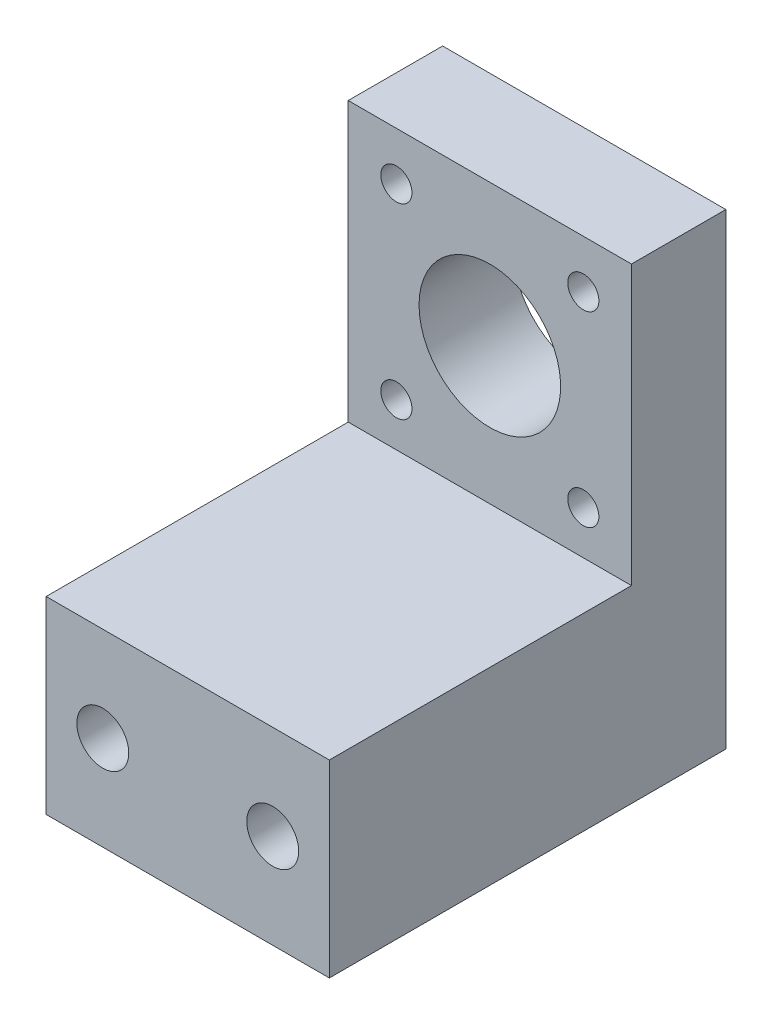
ISO-10303-21;
HEADER;
FILE_DESCRIPTION(('STEP AP214'),'2;1');
FILE_NAME('part.step','',(''),(''),'','','');
FILE_SCHEMA(('AUTOMOTIVE_DESIGN { 1 0 10303 214 1 1 1 1 }'));
ENDSEC;
DATA;
#1=APPLICATION_CONTEXT('core data for automotive mechanical design processes');
#2=APPLICATION_PROTOCOL_DEFINITION('international standard','automotive_design',2000,#1);
#3=PRODUCT_CONTEXT('',#1,'mechanical');
#4=PRODUCT('Part','Part','',(#3));
#5=PRODUCT_RELATED_PRODUCT_CATEGORY('part','',(#4));
#6=PRODUCT_DEFINITION_FORMATION('','',#4);
#7=PRODUCT_DEFINITION_CONTEXT('part definition',#1,'design');
#8=PRODUCT_DEFINITION('design','',#6,#7);
#9=PRODUCT_DEFINITION_SHAPE('','',#8);
#10=(LENGTH_UNIT() NAMED_UNIT(*) SI_UNIT(.MILLI.,.METRE.));
#11=(NAMED_UNIT(*) PLANE_ANGLE_UNIT() SI_UNIT($,.RADIAN.));
#12=(NAMED_UNIT(*) SI_UNIT($,.STERADIAN.) SOLID_ANGLE_UNIT());
#13=UNCERTAINTY_MEASURE_WITH_UNIT(LENGTH_MEASURE(1.E-05),#10,'distance_accuracy_value','');
#14=(GEOMETRIC_REPRESENTATION_CONTEXT(3) GLOBAL_UNCERTAINTY_ASSIGNED_CONTEXT((#13)) GLOBAL_UNIT_ASSIGNED_CONTEXT((#10,
#11,#12)) REPRESENTATION_CONTEXT('',''));
#15=CARTESIAN_POINT('',(0.,0.,0.));
#16=DIRECTION('',(0.,0.,1.));
#17=DIRECTION('',(1.,0.,0.));
#18=AXIS2_PLACEMENT_3D('',#15,#16,#17);
#19=CARTESIAN_POINT('',(6.,10.,42.));
#20=DIRECTION('',(0.,0.,-1.));
#21=DIRECTION('',(-1.,0.,0.));
#22=AXIS2_PLACEMENT_3D('',#19,#20,#21);
#23=CYLINDRICAL_SURFACE('',#22,2.75);
#24=CARTESIAN_POINT('',(6.,10.,42.));
#25=DIRECTION('',(0.,0.,1.));
#26=DIRECTION('',(1.,0.,0.));
#27=AXIS2_PLACEMENT_3D('',#24,#25,#26);
#28=CIRCLE('',#27,2.75);
#29=CARTESIAN_POINT('',(3.25,10.,42.));
#30=VERTEX_POINT('',#29);
#31=EDGE_CURVE('E174',#30,#30,#28,.T.);
#32=CARTESIAN_POINT('',(6.,10.,5.5));
#33=DIRECTION('',(0.,0.,-1.));
#34=DIRECTION('',(-1.,0.,0.));
#35=AXIS2_PLACEMENT_3D('',#32,#33,#34);
#36=CIRCLE('',#35,2.75);
#37=CARTESIAN_POINT('',(3.25,10.,5.50000000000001));
#38=VERTEX_POINT('',#37);
#39=EDGE_CURVE('E37',#38,#38,#36,.T.);
#40=CARTESIAN_POINT('',(3.25,10.,42.));
#41=CARTESIAN_POINT('',(3.25,10.,41.6197916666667));
#42=CARTESIAN_POINT('',(3.25,10.,41.2395833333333));
#43=CARTESIAN_POINT('',(3.25,10.,40.4791666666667));
#44=CARTESIAN_POINT('',(3.25,10.,40.0989583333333));
#45=CARTESIAN_POINT('',(3.25,10.,39.3385416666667));
#46=CARTESIAN_POINT('',(3.25,10.,38.9583333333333));
#47=CARTESIAN_POINT('',(3.25,10.,38.1979166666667));
#48=CARTESIAN_POINT('',(3.25,10.,37.8177083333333));
#49=CARTESIAN_POINT('',(3.25,10.,37.0572916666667));
#50=CARTESIAN_POINT('',(3.25,10.,36.6770833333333));
#51=CARTESIAN_POINT('',(3.25,10.,35.9166666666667));
#52=CARTESIAN_POINT('',(3.25,10.,35.5364583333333));
#53=CARTESIAN_POINT('',(3.25,10.,34.7760416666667));
#54=CARTESIAN_POINT('',(3.25,10.,34.3958333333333));
#55=CARTESIAN_POINT('',(3.25,10.,33.6354166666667));
#56=CARTESIAN_POINT('',(3.25,10.,33.2552083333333));
#57=CARTESIAN_POINT('',(3.25,10.,32.4947916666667));
#58=CARTESIAN_POINT('',(3.25,10.,32.1145833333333));
#59=CARTESIAN_POINT('',(3.25,10.,31.3541666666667));
#60=CARTESIAN_POINT('',(3.25,10.,30.9739583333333));
#61=CARTESIAN_POINT('',(3.25,10.,30.2135416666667));
#62=CARTESIAN_POINT('',(3.25,10.,29.8333333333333));
#63=CARTESIAN_POINT('',(3.25,10.,29.0729166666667));
#64=CARTESIAN_POINT('',(3.25,10.,28.6927083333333));
#65=CARTESIAN_POINT('',(3.25,10.,27.9322916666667));
#66=CARTESIAN_POINT('',(3.25,10.,27.5520833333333));
#67=CARTESIAN_POINT('',(3.25,10.,26.7916666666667));
#68=CARTESIAN_POINT('',(3.25,10.,26.4114583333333));
#69=CARTESIAN_POINT('',(3.25,10.,25.6510416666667));
#70=CARTESIAN_POINT('',(3.25,10.,25.2708333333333));
#71=CARTESIAN_POINT('',(3.25,10.,24.5104166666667));
#72=CARTESIAN_POINT('',(3.25,10.,24.1302083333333));
#73=CARTESIAN_POINT('',(3.25,10.,23.3697916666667));
#74=CARTESIAN_POINT('',(3.25,10.,22.9895833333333));
#75=CARTESIAN_POINT('',(3.25,10.,22.2291666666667));
#76=CARTESIAN_POINT('',(3.25,10.,21.8489583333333));
#77=CARTESIAN_POINT('',(3.25,10.,21.0885416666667));
#78=CARTESIAN_POINT('',(3.25,10.,20.7083333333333));
#79=CARTESIAN_POINT('',(3.25,10.,19.9479166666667));
#80=CARTESIAN_POINT('',(3.25,10.,19.5677083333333));
#81=CARTESIAN_POINT('',(3.25,10.,18.8072916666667));
#82=CARTESIAN_POINT('',(3.25,10.,18.4270833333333));
#83=CARTESIAN_POINT('',(3.25,10.,17.6666666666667));
#84=CARTESIAN_POINT('',(3.25,10.,17.2864583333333));
#85=CARTESIAN_POINT('',(3.25,10.,16.5260416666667));
#86=CARTESIAN_POINT('',(3.25,10.,16.1458333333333));
#87=CARTESIAN_POINT('',(3.25,10.,15.3854166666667));
#88=CARTESIAN_POINT('',(3.25,10.,15.0052083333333));
#89=CARTESIAN_POINT('',(3.25,10.,14.2447916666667));
#90=CARTESIAN_POINT('',(3.25,10.,13.8645833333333));
#91=CARTESIAN_POINT('',(3.25,10.,13.1041666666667));
#92=CARTESIAN_POINT('',(3.25,10.,12.7239583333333));
#93=CARTESIAN_POINT('',(3.25,10.,11.9635416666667));
#94=CARTESIAN_POINT('',(3.25,10.,11.5833333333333));
#95=CARTESIAN_POINT('',(3.25,10.,10.8229166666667));
#96=CARTESIAN_POINT('',(3.25,10.,10.4427083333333));
#97=CARTESIAN_POINT('',(3.25,10.,9.68229166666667));
#98=CARTESIAN_POINT('',(3.25,10.,9.30208333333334));
#99=CARTESIAN_POINT('',(3.25,10.,8.54166666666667));
#100=CARTESIAN_POINT('',(3.25,10.,8.16145833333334));
#101=CARTESIAN_POINT('',(3.25,10.,7.40104166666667));
#102=CARTESIAN_POINT('',(3.25,10.,7.02083333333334));
#103=CARTESIAN_POINT('',(3.25,10.,6.26041666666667));
#104=CARTESIAN_POINT('',(3.25,10.,5.88020833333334));
#105=CARTESIAN_POINT('',(3.25,10.,5.50000000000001));
#106=B_SPLINE_CURVE_WITH_KNOTS('',3,(#40,#41,#42,#43,#44,#45,#46,#47,#48,#49,#50,#51,#52,#53,
#54,#55,#56,#57,#58,#59,#60,#61,#62,#63,#64,#65,#66,#67,#68,#69,#70,#71,#72,#73,#74,#75,#76,#77,
#78,#79,#80,#81,#82,#83,#84,#85,#86,#87,#88,#89,#90,#91,#92,#93,#94,#95,#96,#97,#98,#99,#100,
#101,#102,#103,#104,#105),.UNSPECIFIED.,.F.,.F.,(4,2,2,2,2,2,2,2,2,2,2,2,2,2,2,2,2,2,2,2,2,2,2,
2,2,2,2,2,2,2,2,2,4),(0.,1.140625,2.28125,3.421875,4.5625,5.703125,6.84375,7.98437499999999,
9.12499999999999,10.265625,11.40625,12.546875,13.6875,14.828125,15.96875,17.109375,18.25,
19.390625,20.53125,21.671875,22.8125,23.953125,25.09375,26.234375,27.375,28.515625,29.65625,
30.796875,31.9375,33.078125,34.21875,35.359375,36.5),.UNSPECIFIED.);
#107=EDGE_CURVE('BSEAM33',#30,#38,#106,.T.);
#108=ORIENTED_EDGE('',*,*,#31,.T.);
#109=ORIENTED_EDGE('',*,*,#39,.T.);
#110=ORIENTED_EDGE('',*,*,#107,.T.);
#111=ORIENTED_EDGE('',*,*,#107,.F.);
#112=EDGE_LOOP('',(#108,#110,#109,#111));
#113=FACE_BOUND('',#112,.T.);
#114=ADVANCED_FACE('F33',(#113),#23,.F.);
#115=CARTESIAN_POINT('',(24.,10.,42.));
#116=DIRECTION('',(0.,0.,-1.));
#117=DIRECTION('',(-1.,0.,0.));
#118=AXIS2_PLACEMENT_3D('',#115,#116,#117);
#119=CYLINDRICAL_SURFACE('',#118,2.75);
#120=CARTESIAN_POINT('',(24.,10.,42.));
#121=DIRECTION('',(0.,0.,1.));
#122=DIRECTION('',(1.,0.,0.));
#123=AXIS2_PLACEMENT_3D('',#120,#121,#122);
#124=CIRCLE('',#123,2.75);
#125=CARTESIAN_POINT('',(21.25,10.,42.));
#126=VERTEX_POINT('',#125);
#127=EDGE_CURVE('E107',#126,#126,#124,.T.);
#128=CARTESIAN_POINT('',(24.,10.,5.5));
#129=DIRECTION('',(0.,0.,-1.));
#130=DIRECTION('',(-1.,0.,0.));
#131=AXIS2_PLACEMENT_3D('',#128,#129,#130);
#132=CIRCLE('',#131,2.75);
#133=CARTESIAN_POINT('',(21.25,10.,5.50000000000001));
#134=VERTEX_POINT('',#133);
#135=EDGE_CURVE('E121',#134,#134,#132,.T.);
#136=CARTESIAN_POINT('',(21.25,10.,42.));
#137=CARTESIAN_POINT('',(21.25,10.,41.6197916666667));
#138=CARTESIAN_POINT('',(21.25,10.,41.2395833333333));
#139=CARTESIAN_POINT('',(21.25,10.,40.4791666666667));
#140=CARTESIAN_POINT('',(21.25,10.,40.0989583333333));
#141=CARTESIAN_POINT('',(21.25,10.,39.3385416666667));
#142=CARTESIAN_POINT('',(21.25,10.,38.9583333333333));
#143=CARTESIAN_POINT('',(21.25,10.,38.1979166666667));
#144=CARTESIAN_POINT('',(21.25,10.,37.8177083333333));
#145=CARTESIAN_POINT('',(21.25,10.,37.0572916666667));
#146=CARTESIAN_POINT('',(21.25,10.,36.6770833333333));
#147=CARTESIAN_POINT('',(21.25,10.,35.9166666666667));
#148=CARTESIAN_POINT('',(21.25,10.,35.5364583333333));
#149=CARTESIAN_POINT('',(21.25,10.,34.7760416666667));
#150=CARTESIAN_POINT('',(21.25,10.,34.3958333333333));
#151=CARTESIAN_POINT('',(21.25,10.,33.6354166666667));
#152=CARTESIAN_POINT('',(21.25,10.,33.2552083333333));
#153=CARTESIAN_POINT('',(21.25,10.,32.4947916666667));
#154=CARTESIAN_POINT('',(21.25,10.,32.1145833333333));
#155=CARTESIAN_POINT('',(21.25,10.,31.3541666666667));
#156=CARTESIAN_POINT('',(21.25,10.,30.9739583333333));
#157=CARTESIAN_POINT('',(21.25,10.,30.2135416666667));
#158=CARTESIAN_POINT('',(21.25,10.,29.8333333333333));
#159=CARTESIAN_POINT('',(21.25,10.,29.0729166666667));
#160=CARTESIAN_POINT('',(21.25,10.,28.6927083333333));
#161=CARTESIAN_POINT('',(21.25,10.,27.9322916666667));
#162=CARTESIAN_POINT('',(21.25,10.,27.5520833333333));
#163=CARTESIAN_POINT('',(21.25,10.,26.7916666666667));
#164=CARTESIAN_POINT('',(21.25,10.,26.4114583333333));
#165=CARTESIAN_POINT('',(21.25,10.,25.6510416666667));
#166=CARTESIAN_POINT('',(21.25,10.,25.2708333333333));
#167=CARTESIAN_POINT('',(21.25,10.,24.5104166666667));
#168=CARTESIAN_POINT('',(21.25,10.,24.1302083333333));
#169=CARTESIAN_POINT('',(21.25,10.,23.3697916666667));
#170=CARTESIAN_POINT('',(21.25,10.,22.9895833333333));
#171=CARTESIAN_POINT('',(21.25,10.,22.2291666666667));
#172=CARTESIAN_POINT('',(21.25,10.,21.8489583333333));
#173=CARTESIAN_POINT('',(21.25,10.,21.0885416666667));
#174=CARTESIAN_POINT('',(21.25,10.,20.7083333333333));
#175=CARTESIAN_POINT('',(21.25,10.,19.9479166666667));
#176=CARTESIAN_POINT('',(21.25,10.,19.5677083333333));
#177=CARTESIAN_POINT('',(21.25,10.,18.8072916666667));
#178=CARTESIAN_POINT('',(21.25,10.,18.4270833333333));
#179=CARTESIAN_POINT('',(21.25,10.,17.6666666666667));
#180=CARTESIAN_POINT('',(21.25,10.,17.2864583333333));
#181=CARTESIAN_POINT('',(21.25,10.,16.5260416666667));
#182=CARTESIAN_POINT('',(21.25,10.,16.1458333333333));
#183=CARTESIAN_POINT('',(21.25,10.,15.3854166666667));
#184=CARTESIAN_POINT('',(21.25,10.,15.0052083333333));
#185=CARTESIAN_POINT('',(21.25,10.,14.2447916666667));
#186=CARTESIAN_POINT('',(21.25,10.,13.8645833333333));
#187=CARTESIAN_POINT('',(21.25,10.,13.1041666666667));
#188=CARTESIAN_POINT('',(21.25,10.,12.7239583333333));
#189=CARTESIAN_POINT('',(21.25,10.,11.9635416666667));
#190=CARTESIAN_POINT('',(21.25,10.,11.5833333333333));
#191=CARTESIAN_POINT('',(21.25,10.,10.8229166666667));
#192=CARTESIAN_POINT('',(21.25,10.,10.4427083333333));
#193=CARTESIAN_POINT('',(21.25,10.,9.68229166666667));
#194=CARTESIAN_POINT('',(21.25,10.,9.30208333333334));
#195=CARTESIAN_POINT('',(21.25,10.,8.54166666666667));
#196=CARTESIAN_POINT('',(21.25,10.,8.16145833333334));
#197=CARTESIAN_POINT('',(21.25,10.,7.40104166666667));
#198=CARTESIAN_POINT('',(21.25,10.,7.02083333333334));
#199=CARTESIAN_POINT('',(21.25,10.,6.26041666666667));
#200=CARTESIAN_POINT('',(21.25,10.,5.88020833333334));
#201=CARTESIAN_POINT('',(21.25,10.,5.50000000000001));
#202=B_SPLINE_CURVE_WITH_KNOTS('',3,(#136,#137,#138,#139,#140,#141,#142,#143,#144,#145,#146,
#147,#148,#149,#150,#151,#152,#153,#154,#155,#156,#157,#158,#159,#160,#161,#162,#163,#164,#165,
#166,#167,#168,#169,#170,#171,#172,#173,#174,#175,#176,#177,#178,#179,#180,#181,#182,#183,#184,
#185,#186,#187,#188,#189,#190,#191,#192,#193,#194,#195,#196,#197,#198,#199,#200,#201),
.UNSPECIFIED.,.F.,.F.,(4,2,2,2,2,2,2,2,2,2,2,2,2,2,2,2,2,2,2,2,2,2,2,2,2,2,2,2,2,2,2,2,4),(0.,
1.140625,2.28125,3.421875,4.5625,5.703125,6.84375,7.98437499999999,9.12499999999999,10.265625,
11.40625,12.546875,13.6875,14.828125,15.96875,17.109375,18.25,19.390625,20.53125,21.671875,
22.8125,23.953125,25.09375,26.234375,27.375,28.515625,29.65625,30.796875,31.9375,33.078125,
34.21875,35.359375,36.5),.UNSPECIFIED.);
#203=EDGE_CURVE('BSEAM209',#126,#134,#202,.T.);
#204=ORIENTED_EDGE('',*,*,#127,.T.);
#205=ORIENTED_EDGE('',*,*,#135,.T.);
#206=ORIENTED_EDGE('',*,*,#203,.T.);
#207=ORIENTED_EDGE('',*,*,#203,.F.);
#208=EDGE_LOOP('',(#204,#206,#205,#207));
#209=FACE_BOUND('',#208,.T.);
#210=ADVANCED_FACE('F209',(#209),#119,.F.);
#211=CARTESIAN_POINT('',(30.,-1.13686837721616E-13,42.));
#212=DIRECTION('',(0.,0.,1.));
#213=DIRECTION('',(1.,0.,0.));
#214=AXIS2_PLACEMENT_3D('',#211,#212,#213);
#215=PLANE('',#214);
#216=ORIENTED_EDGE('',*,*,#31,.F.);
#217=EDGE_LOOP('',(#216));
#218=FACE_BOUND('',#217,.T.);
#219=ORIENTED_EDGE('',*,*,#127,.F.);
#220=EDGE_LOOP('',(#219));
#221=FACE_BOUND('',#220,.T.);
#222=DIRECTION('',(0.,1.,0.));
#223=VECTOR('',#222,1.);
#224=CARTESIAN_POINT('',(30.,-1.13686837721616E-13,42.));
#225=LINE('',#224,#223);
#226=CARTESIAN_POINT('',(30.,-1.13686837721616E-13,42.));
#227=VERTEX_POINT('',#226);
#228=CARTESIAN_POINT('',(30.,20.,42.));
#229=VERTEX_POINT('',#228);
#230=EDGE_CURVE('E179',#227,#229,#225,.T.);
#231=ORIENTED_EDGE('',*,*,#230,.T.);
#232=DIRECTION('',(1.,0.,0.));
#233=VECTOR('',#232,1.);
#234=CARTESIAN_POINT('',(-12.,20.,42.));
#235=LINE('',#234,#233);
#236=CARTESIAN_POINT('',(0.,20.,42.));
#237=VERTEX_POINT('',#236);
#238=EDGE_CURVE('E120',#237,#229,#235,.T.);
#239=ORIENTED_EDGE('',*,*,#238,.F.);
#240=DIRECTION('',(0.,-1.,0.));
#241=VECTOR('',#240,1.);
#242=CARTESIAN_POINT('',(0.,-1.13686837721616E-13,42.));
#243=LINE('',#242,#241);
#244=CARTESIAN_POINT('',(0.,-1.13686837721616E-13,42.));
#245=VERTEX_POINT('',#244);
#246=EDGE_CURVE('E59',#237,#245,#243,.T.);
#247=ORIENTED_EDGE('',*,*,#246,.T.);
#248=DIRECTION('',(1.,0.,0.));
#249=VECTOR('',#248,1.);
#250=CARTESIAN_POINT('',(0.,-1.13686837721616E-13,42.));
#251=LINE('',#250,#249);
#252=EDGE_CURVE('E90',#245,#227,#251,.T.);
#253=ORIENTED_EDGE('',*,*,#252,.T.);
#254=EDGE_LOOP('',(#231,#239,#247,#253));
#255=FACE_BOUND('',#254,.T.);
#256=ADVANCED_FACE('F182',(#218,#221,#255),#215,.T.);
#257=CARTESIAN_POINT('',(30.,-1.13686837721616E-13,42.));
#258=DIRECTION('',(-1.,0.,0.));
#259=DIRECTION('',(0.,0.,1.));
#260=AXIS2_PLACEMENT_3D('',#257,#258,#259);
#261=PLANE('',#260);
#262=DIRECTION('',(0.,0.,1.));
#263=VECTOR('',#262,1.);
#264=CARTESIAN_POINT('',(30.,20.,42.));
#265=LINE('',#264,#263);
#266=CARTESIAN_POINT('',(30.,20.,10.));
#267=VERTEX_POINT('',#266);
#268=EDGE_CURVE('E164',#267,#229,#265,.T.);
#269=ORIENTED_EDGE('',*,*,#268,.T.);
#270=ORIENTED_EDGE('',*,*,#230,.F.);
#271=DIRECTION('',(0.,0.,-1.));
#272=VECTOR('',#271,1.);
#273=CARTESIAN_POINT('',(30.,-1.13686837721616E-13,42.));
#274=LINE('',#273,#272);
#275=CARTESIAN_POINT('',(30.,-1.13686837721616E-13,0.));
#276=VERTEX_POINT('',#275);
#277=EDGE_CURVE('E42',#227,#276,#274,.T.);
#278=ORIENTED_EDGE('',*,*,#277,.T.);
#279=DIRECTION('',(0.,1.,0.));
#280=VECTOR('',#279,1.);
#281=CARTESIAN_POINT('',(30.,-1.13686837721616E-13,0.));
#282=LINE('',#281,#280);
#283=CARTESIAN_POINT('',(30.,49.5,0.));
#284=VERTEX_POINT('',#283);
#285=EDGE_CURVE('E101',#276,#284,#282,.T.);
#286=ORIENTED_EDGE('',*,*,#285,.T.);
#287=DIRECTION('',(0.,0.,-1.));
#288=VECTOR('',#287,1.);
#289=CARTESIAN_POINT('',(30.,49.5,42.));
#290=LINE('',#289,#288);
#291=CARTESIAN_POINT('',(30.,49.5,10.));
#292=VERTEX_POINT('',#291);
#293=EDGE_CURVE('E114',#292,#284,#290,.T.);
#294=ORIENTED_EDGE('',*,*,#293,.F.);
#295=DIRECTION('',(0.,-1.,0.));
#296=VECTOR('',#295,1.);
#297=CARTESIAN_POINT('',(30.,20.,10.));
#298=LINE('',#297,#296);
#299=EDGE_CURVE('E161',#292,#267,#298,.T.);
#300=ORIENTED_EDGE('',*,*,#299,.T.);
#301=EDGE_LOOP('',(#269,#270,#278,#286,#294,#300));
#302=FACE_BOUND('',#301,.T.);
#303=ADVANCED_FACE('F187',(#302),#261,.F.);
#304=CARTESIAN_POINT('',(0.,49.5,42.));
#305=DIRECTION('',(0.,-1.,0.));
#306=DIRECTION('',(0.,0.,-1.));
#307=AXIS2_PLACEMENT_3D('',#304,#305,#306);
#308=PLANE('',#307);
#309=DIRECTION('',(1.,0.,0.));
#310=VECTOR('',#309,1.);
#311=CARTESIAN_POINT('',(-12.,49.5,10.));
#312=LINE('',#311,#310);
#313=CARTESIAN_POINT('',(0.,49.5,10.));
#314=VERTEX_POINT('',#313);
#315=EDGE_CURVE('E50',#314,#292,#312,.T.);
#316=ORIENTED_EDGE('',*,*,#315,.T.);
#317=ORIENTED_EDGE('',*,*,#293,.T.);
#318=DIRECTION('',(-1.,0.,0.));
#319=VECTOR('',#318,1.);
#320=CARTESIAN_POINT('',(0.,49.5,0.));
#321=LINE('',#320,#319);
#322=CARTESIAN_POINT('',(0.,49.5,0.));
#323=VERTEX_POINT('',#322);
#324=EDGE_CURVE('E91',#284,#323,#321,.T.);
#325=ORIENTED_EDGE('',*,*,#324,.T.);
#326=DIRECTION('',(0.,0.,-1.));
#327=VECTOR('',#326,1.);
#328=CARTESIAN_POINT('',(0.,49.5,42.));
#329=LINE('',#328,#327);
#330=EDGE_CURVE('E85',#314,#323,#329,.T.);
#331=ORIENTED_EDGE('',*,*,#330,.F.);
#332=EDGE_LOOP('',(#316,#317,#325,#331));
#333=FACE_BOUND('',#332,.T.);
#334=ADVANCED_FACE('F199',(#333),#308,.F.);
#335=CARTESIAN_POINT('',(0.,-1.13686837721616E-13,42.));
#336=DIRECTION('',(1.,0.,0.));
#337=DIRECTION('',(0.,0.,-1.));
#338=AXIS2_PLACEMENT_3D('',#335,#336,#337);
#339=PLANE('',#338);
#340=DIRECTION('',(0.,0.,1.));
#341=VECTOR('',#340,1.);
#342=CARTESIAN_POINT('',(0.,20.,42.));
#343=LINE('',#342,#341);
#344=CARTESIAN_POINT('',(0.,20.,10.));
#345=VERTEX_POINT('',#344);
#346=EDGE_CURVE('E12',#345,#237,#343,.T.);
#347=ORIENTED_EDGE('',*,*,#346,.F.);
#348=DIRECTION('',(0.,-1.,0.));
#349=VECTOR('',#348,1.);
#350=CARTESIAN_POINT('',(0.,-1.13686837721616E-13,10.));
#351=LINE('',#350,#349);
#352=EDGE_CURVE('E119',#314,#345,#351,.T.);
#353=ORIENTED_EDGE('',*,*,#352,.F.);
#354=ORIENTED_EDGE('',*,*,#330,.T.);
#355=DIRECTION('',(0.,-1.,0.));
#356=VECTOR('',#355,1.);
#357=CARTESIAN_POINT('',(0.,-1.13686837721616E-13,0.));
#358=LINE('',#357,#356);
#359=CARTESIAN_POINT('',(0.,-1.13686837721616E-13,0.));
#360=VERTEX_POINT('',#359);
#361=EDGE_CURVE('E78',#323,#360,#358,.T.);
#362=ORIENTED_EDGE('',*,*,#361,.T.);
#363=DIRECTION('',(0.,0.,-1.));
#364=VECTOR('',#363,1.);
#365=CARTESIAN_POINT('',(0.,-1.13686837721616E-13,42.));
#366=LINE('',#365,#364);
#367=EDGE_CURVE('E82',#245,#360,#366,.T.);
#368=ORIENTED_EDGE('',*,*,#367,.F.);
#369=ORIENTED_EDGE('',*,*,#246,.F.);
#370=EDGE_LOOP('',(#347,#353,#354,#362,#368,#369));
#371=FACE_BOUND('',#370,.T.);
#372=ADVANCED_FACE('F81',(#371),#339,.F.);
#373=CARTESIAN_POINT('',(15.,34.5,42.));
#374=DIRECTION('',(0.,0.,-1.));
#375=DIRECTION('',(-1.,0.,0.));
#376=AXIS2_PLACEMENT_3D('',#373,#374,#375);
#377=CYLINDRICAL_SURFACE('',#376,7.5);
#378=CARTESIAN_POINT('',(15.,34.5,0.));
#379=DIRECTION('',(0.,0.,1.));
#380=DIRECTION('',(1.,0.,0.));
#381=AXIS2_PLACEMENT_3D('',#378,#379,#380);
#382=CIRCLE('',#381,7.5);
#383=CARTESIAN_POINT('',(7.5,34.5,0.));
#384=VERTEX_POINT('',#383);
#385=EDGE_CURVE('E103',#384,#384,#382,.T.);
#386=CARTESIAN_POINT('',(15.,34.5,10.));
#387=DIRECTION('',(0.,0.,1.));
#388=DIRECTION('',(1.,0.,0.));
#389=AXIS2_PLACEMENT_3D('',#386,#387,#388);
#390=CIRCLE('',#389,7.5);
#391=CARTESIAN_POINT('',(7.5,34.5,9.99999999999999));
#392=VERTEX_POINT('',#391);
#393=EDGE_CURVE('E117',#392,#392,#390,.T.);
#394=CARTESIAN_POINT('',(7.5,34.5,0.));
#395=CARTESIAN_POINT('',(7.5,34.5,0.104166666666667));
#396=CARTESIAN_POINT('',(7.5,34.5,0.208333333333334));
#397=CARTESIAN_POINT('',(7.5,34.5,0.416666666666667));
#398=CARTESIAN_POINT('',(7.5,34.5,0.520833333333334));
#399=CARTESIAN_POINT('',(7.5,34.5,0.729166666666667));
#400=CARTESIAN_POINT('',(7.5,34.5,0.833333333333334));
#401=CARTESIAN_POINT('',(7.5,34.5,1.04166666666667));
#402=CARTESIAN_POINT('',(7.5,34.5,1.14583333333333));
#403=CARTESIAN_POINT('',(7.5,34.5,1.35416666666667));
#404=CARTESIAN_POINT('',(7.5,34.5,1.45833333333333));
#405=CARTESIAN_POINT('',(7.5,34.5,1.66666666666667));
#406=CARTESIAN_POINT('',(7.5,34.5,1.77083333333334));
#407=CARTESIAN_POINT('',(7.5,34.5,1.97916666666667));
#408=CARTESIAN_POINT('',(7.5,34.5,2.08333333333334));
#409=CARTESIAN_POINT('',(7.5,34.5,2.29166666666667));
#410=CARTESIAN_POINT('',(7.5,34.5,2.39583333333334));
#411=CARTESIAN_POINT('',(7.5,34.5,2.60416666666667));
#412=CARTESIAN_POINT('',(7.5,34.5,2.70833333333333));
#413=CARTESIAN_POINT('',(7.5,34.5,2.91666666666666));
#414=CARTESIAN_POINT('',(7.5,34.5,3.02083333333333));
#415=CARTESIAN_POINT('',(7.5,34.5,3.22916666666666));
#416=CARTESIAN_POINT('',(7.5,34.5,3.33333333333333));
#417=CARTESIAN_POINT('',(7.5,34.5,3.54166666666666));
#418=CARTESIAN_POINT('',(7.5,34.5,3.64583333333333));
#419=CARTESIAN_POINT('',(7.5,34.5,3.85416666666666));
#420=CARTESIAN_POINT('',(7.5,34.5,3.95833333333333));
#421=CARTESIAN_POINT('',(7.5,34.5,4.16666666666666));
#422=CARTESIAN_POINT('',(7.5,34.5,4.27083333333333));
#423=CARTESIAN_POINT('',(7.5,34.5,4.47916666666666));
#424=CARTESIAN_POINT('',(7.5,34.5,4.58333333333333));
#425=CARTESIAN_POINT('',(7.5,34.5,4.79166666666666));
#426=CARTESIAN_POINT('',(7.5,34.5,4.89583333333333));
#427=CARTESIAN_POINT('',(7.5,34.5,5.10416666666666));
#428=CARTESIAN_POINT('',(7.5,34.5,5.20833333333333));
#429=CARTESIAN_POINT('',(7.5,34.5,5.41666666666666));
#430=CARTESIAN_POINT('',(7.5,34.5,5.52083333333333));
#431=CARTESIAN_POINT('',(7.5,34.5,5.72916666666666));
#432=CARTESIAN_POINT('',(7.5,34.5,5.83333333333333));
#433=CARTESIAN_POINT('',(7.5,34.5,6.04166666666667));
#434=CARTESIAN_POINT('',(7.5,34.5,6.14583333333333));
#435=CARTESIAN_POINT('',(7.5,34.5,6.35416666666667));
#436=CARTESIAN_POINT('',(7.5,34.5,6.45833333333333));
#437=CARTESIAN_POINT('',(7.5,34.5,6.66666666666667));
#438=CARTESIAN_POINT('',(7.5,34.5,6.77083333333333));
#439=CARTESIAN_POINT('',(7.5,34.5,6.97916666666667));
#440=CARTESIAN_POINT('',(7.5,34.5,7.08333333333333));
#441=CARTESIAN_POINT('',(7.5,34.5,7.29166666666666));
#442=CARTESIAN_POINT('',(7.5,34.5,7.39583333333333));
#443=CARTESIAN_POINT('',(7.5,34.5,7.60416666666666));
#444=CARTESIAN_POINT('',(7.5,34.5,7.70833333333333));
#445=CARTESIAN_POINT('',(7.5,34.5,7.91666666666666));
#446=CARTESIAN_POINT('',(7.5,34.5,8.02083333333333));
#447=CARTESIAN_POINT('',(7.5,34.5,8.22916666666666));
#448=CARTESIAN_POINT('',(7.5,34.5,8.33333333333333));
#449=CARTESIAN_POINT('',(7.5,34.5,8.54166666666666));
#450=CARTESIAN_POINT('',(7.5,34.5,8.64583333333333));
#451=CARTESIAN_POINT('',(7.5,34.5,8.85416666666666));
#452=CARTESIAN_POINT('',(7.5,34.5,8.95833333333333));
#453=CARTESIAN_POINT('',(7.5,34.5,9.16666666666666));
#454=CARTESIAN_POINT('',(7.5,34.5,9.27083333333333));
#455=CARTESIAN_POINT('',(7.5,34.5,9.47916666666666));
#456=CARTESIAN_POINT('',(7.5,34.5,9.58333333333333));
#457=CARTESIAN_POINT('',(7.5,34.5,9.79166666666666));
#458=CARTESIAN_POINT('',(7.5,34.5,9.89583333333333));
#459=CARTESIAN_POINT('',(7.5,34.5,9.99999999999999));
#460=B_SPLINE_CURVE_WITH_KNOTS('',3,(#394,#395,#396,#397,#398,#399,#400,#401,#402,#403,#404,
#405,#406,#407,#408,#409,#410,#411,#412,#413,#414,#415,#416,#417,#418,#419,#420,#421,#422,#423,
#424,#425,#426,#427,#428,#429,#430,#431,#432,#433,#434,#435,#436,#437,#438,#439,#440,#441,#442,
#443,#444,#445,#446,#447,#448,#449,#450,#451,#452,#453,#454,#455,#456,#457,#458,#459),
.UNSPECIFIED.,.F.,.F.,(4,2,2,2,2,2,2,2,2,2,2,2,2,2,2,2,2,2,2,2,2,2,2,2,2,2,2,2,2,2,2,2,4),(0.,
0.3125,0.625000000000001,0.937500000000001,1.25,1.5625,1.875,2.1875,2.5,2.8125,3.125,3.4375,
3.75,4.0625,4.375,4.6875,5.,5.3125,5.625,5.9375,6.25,6.5625,6.875,7.1875,7.49999999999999,
7.8125,8.12499999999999,8.43749999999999,8.74999999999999,9.06249999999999,9.37499999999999,
9.68749999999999,9.99999999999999),.UNSPECIFIED.);
#461=EDGE_CURVE('BSEAM206',#384,#392,#460,.T.);
#462=ORIENTED_EDGE('',*,*,#385,.F.);
#463=ORIENTED_EDGE('',*,*,#393,.T.);
#464=ORIENTED_EDGE('',*,*,#461,.T.);
#465=ORIENTED_EDGE('',*,*,#461,.F.);
#466=EDGE_LOOP('',(#462,#464,#463,#465));
#467=FACE_BOUND('',#466,.T.);
#468=ADVANCED_FACE('F206',(#467),#377,.F.);
#469=CARTESIAN_POINT('',(30.,-1.13686837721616E-13,0.));
#470=DIRECTION('',(0.,0.,1.));
#471=DIRECTION('',(1.,0.,0.));
#472=AXIS2_PLACEMENT_3D('',#469,#470,#471);
#473=PLANE('',#472);
#474=CARTESIAN_POINT('',(6.,10.,0.));
#475=DIRECTION('',(0.,0.,-1.));
#476=DIRECTION('',(-1.,0.,0.));
#477=AXIS2_PLACEMENT_3D('',#474,#475,#476);
#478=CIRCLE('',#477,4.75);
#479=CARTESIAN_POINT('',(1.25,10.,0.));
#480=VERTEX_POINT('',#479);
#481=EDGE_CURVE('E138',#480,#480,#478,.T.);
#482=ORIENTED_EDGE('',*,*,#481,.F.);
#483=EDGE_LOOP('',(#482));
#484=FACE_BOUND('',#483,.T.);
#485=CARTESIAN_POINT('',(24.,10.,0.));
#486=DIRECTION('',(0.,0.,-1.));
#487=DIRECTION('',(-1.,0.,0.));
#488=AXIS2_PLACEMENT_3D('',#485,#486,#487);
#489=CIRCLE('',#488,4.75);
#490=CARTESIAN_POINT('',(19.25,10.,0.));
#491=VERTEX_POINT('',#490);
#492=EDGE_CURVE('E131',#491,#491,#489,.T.);
#493=ORIENTED_EDGE('',*,*,#492,.F.);
#494=EDGE_LOOP('',(#493));
#495=FACE_BOUND('',#494,.T.);
#496=CARTESIAN_POINT('',(5.09999999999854,44.4000000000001,0.));
#497=DIRECTION('',(0.,0.,1.));
#498=DIRECTION('',(1.,0.,0.));
#499=AXIS2_PLACEMENT_3D('',#496,#497,#498);
#500=CIRCLE('',#499,1.65);
#501=CARTESIAN_POINT('',(6.74999999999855,44.4000000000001,0.));
#502=VERTEX_POINT('',#501);
#503=EDGE_CURVE('E128',#502,#502,#500,.T.);
#504=ORIENTED_EDGE('',*,*,#503,.T.);
#505=EDGE_LOOP('',(#504));
#506=FACE_BOUND('',#505,.T.);
#507=CARTESIAN_POINT('',(24.8999999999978,24.5999999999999,0.));
#508=DIRECTION('',(0.,0.,1.));
#509=DIRECTION('',(1.,0.,0.));
#510=AXIS2_PLACEMENT_3D('',#507,#508,#509);
#511=CIRCLE('',#510,1.65);
#512=CARTESIAN_POINT('',(26.5499999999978,24.5999999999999,0.));
#513=VERTEX_POINT('',#512);
#514=EDGE_CURVE('E146',#513,#513,#511,.T.);
#515=ORIENTED_EDGE('',*,*,#514,.T.);
#516=EDGE_LOOP('',(#515));
#517=FACE_BOUND('',#516,.T.);
#518=CARTESIAN_POINT('',(24.8999999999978,44.4000000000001,0.));
#519=DIRECTION('',(0.,0.,1.));
#520=DIRECTION('',(1.,0.,0.));
#521=AXIS2_PLACEMENT_3D('',#518,#519,#520);
#522=CIRCLE('',#521,1.65);
#523=CARTESIAN_POINT('',(26.5499999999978,44.4000000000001,0.));
#524=VERTEX_POINT('',#523);
#525=EDGE_CURVE('E152',#524,#524,#522,.T.);
#526=ORIENTED_EDGE('',*,*,#525,.T.);
#527=EDGE_LOOP('',(#526));
#528=FACE_BOUND('',#527,.T.);
#529=CARTESIAN_POINT('',(5.09999999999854,24.5999999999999,0.));
#530=DIRECTION('',(0.,0.,1.));
#531=DIRECTION('',(1.,0.,0.));
#532=AXIS2_PLACEMENT_3D('',#529,#530,#531);
#533=CIRCLE('',#532,1.65);
#534=CARTESIAN_POINT('',(6.74999999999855,24.5999999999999,0.));
#535=VERTEX_POINT('',#534);
#536=EDGE_CURVE('E158',#535,#535,#533,.T.);
#537=ORIENTED_EDGE('',*,*,#536,.T.);
#538=EDGE_LOOP('',(#537));
#539=FACE_BOUND('',#538,.T.);
#540=DIRECTION('',(1.,0.,0.));
#541=VECTOR('',#540,1.);
#542=CARTESIAN_POINT('',(0.,-1.13686837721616E-13,0.));
#543=LINE('',#542,#541);
#544=EDGE_CURVE('E96',#360,#276,#543,.T.);
#545=ORIENTED_EDGE('',*,*,#544,.F.);
#546=ORIENTED_EDGE('',*,*,#361,.F.);
#547=ORIENTED_EDGE('',*,*,#324,.F.);
#548=ORIENTED_EDGE('',*,*,#285,.F.);
#549=EDGE_LOOP('',(#545,#546,#547,#548));
#550=FACE_BOUND('',#549,.T.);
#551=ORIENTED_EDGE('',*,*,#385,.T.);
#552=EDGE_LOOP('',(#551));
#553=FACE_BOUND('',#552,.T.);
#554=ADVANCED_FACE('F98',(#484,#495,#506,#517,#528,#539,#550,#553),#473,.F.);
#555=CARTESIAN_POINT('',(0.,-1.13686837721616E-13,42.));
#556=DIRECTION('',(0.,1.,0.));
#557=DIRECTION('',(0.,0.,1.));
#558=AXIS2_PLACEMENT_3D('',#555,#556,#557);
#559=PLANE('',#558);
#560=ORIENTED_EDGE('',*,*,#544,.T.);
#561=ORIENTED_EDGE('',*,*,#277,.F.);
#562=ORIENTED_EDGE('',*,*,#252,.F.);
#563=ORIENTED_EDGE('',*,*,#367,.T.);
#564=EDGE_LOOP('',(#560,#561,#562,#563));
#565=FACE_BOUND('',#564,.T.);
#566=ADVANCED_FACE('F35',(#565),#559,.F.);
#567=CARTESIAN_POINT('',(-12.,20.,42.));
#568=DIRECTION('',(0.,1.,0.));
#569=DIRECTION('',(0.,0.,1.));
#570=AXIS2_PLACEMENT_3D('',#567,#568,#569);
#571=PLANE('',#570);
#572=ORIENTED_EDGE('',*,*,#346,.T.);
#573=ORIENTED_EDGE('',*,*,#238,.T.);
#574=ORIENTED_EDGE('',*,*,#268,.F.);
#575=DIRECTION('',(1.,0.,0.));
#576=VECTOR('',#575,1.);
#577=CARTESIAN_POINT('',(-12.,20.,10.));
#578=LINE('',#577,#576);
#579=EDGE_CURVE('E169',#345,#267,#578,.T.);
#580=ORIENTED_EDGE('',*,*,#579,.F.);
#581=EDGE_LOOP('',(#572,#573,#574,#580));
#582=FACE_BOUND('',#581,.T.);
#583=ADVANCED_FACE('F192',(#582),#571,.T.);
#584=CARTESIAN_POINT('',(-12.,20.,10.));
#585=DIRECTION('',(0.,0.,1.));
#586=DIRECTION('',(1.,0.,0.));
#587=AXIS2_PLACEMENT_3D('',#584,#585,#586);
#588=PLANE('',#587);
#589=CARTESIAN_POINT('',(5.09999999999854,44.4000000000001,10.));
#590=DIRECTION('',(0.,0.,1.));
#591=DIRECTION('',(1.,0.,0.));
#592=AXIS2_PLACEMENT_3D('',#589,#590,#591);
#593=CIRCLE('',#592,1.65);
#594=CARTESIAN_POINT('',(6.74999999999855,44.4000000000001,10.));
#595=VERTEX_POINT('',#594);
#596=EDGE_CURVE('E123',#595,#595,#593,.T.);
#597=ORIENTED_EDGE('',*,*,#596,.F.);
#598=EDGE_LOOP('',(#597));
#599=FACE_BOUND('',#598,.T.);
#600=CARTESIAN_POINT('',(24.8999999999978,24.5999999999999,10.));
#601=DIRECTION('',(0.,0.,1.));
#602=DIRECTION('',(1.,0.,0.));
#603=AXIS2_PLACEMENT_3D('',#600,#601,#602);
#604=CIRCLE('',#603,1.65);
#605=CARTESIAN_POINT('',(26.5499999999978,24.5999999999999,10.));
#606=VERTEX_POINT('',#605);
#607=EDGE_CURVE('E143',#606,#606,#604,.T.);
#608=ORIENTED_EDGE('',*,*,#607,.F.);
#609=EDGE_LOOP('',(#608));
#610=FACE_BOUND('',#609,.T.);
#611=CARTESIAN_POINT('',(24.8999999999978,44.4000000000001,10.));
#612=DIRECTION('',(0.,0.,1.));
#613=DIRECTION('',(1.,0.,0.));
#614=AXIS2_PLACEMENT_3D('',#611,#612,#613);
#615=CIRCLE('',#614,1.65);
#616=CARTESIAN_POINT('',(26.5499999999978,44.4000000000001,10.));
#617=VERTEX_POINT('',#616);
#618=EDGE_CURVE('E149',#617,#617,#615,.T.);
#619=ORIENTED_EDGE('',*,*,#618,.F.);
#620=EDGE_LOOP('',(#619));
#621=FACE_BOUND('',#620,.T.);
#622=CARTESIAN_POINT('',(5.09999999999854,24.5999999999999,10.));
#623=DIRECTION('',(0.,0.,1.));
#624=DIRECTION('',(1.,0.,0.));
#625=AXIS2_PLACEMENT_3D('',#622,#623,#624);
#626=CIRCLE('',#625,1.65);
#627=CARTESIAN_POINT('',(6.74999999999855,24.5999999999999,10.));
#628=VERTEX_POINT('',#627);
#629=EDGE_CURVE('E155',#628,#628,#626,.T.);
#630=ORIENTED_EDGE('',*,*,#629,.F.);
#631=EDGE_LOOP('',(#630));
#632=FACE_BOUND('',#631,.T.);
#633=ORIENTED_EDGE('',*,*,#393,.F.);
#634=EDGE_LOOP('',(#633));
#635=FACE_BOUND('',#634,.T.);
#636=ORIENTED_EDGE('',*,*,#352,.T.);
#637=ORIENTED_EDGE('',*,*,#579,.T.);
#638=ORIENTED_EDGE('',*,*,#299,.F.);
#639=ORIENTED_EDGE('',*,*,#315,.F.);
#640=EDGE_LOOP('',(#636,#637,#638,#639));
#641=FACE_BOUND('',#640,.T.);
#642=ADVANCED_FACE('F197',(#599,#610,#621,#632,#635,#641),#588,.T.);
#643=CARTESIAN_POINT('',(5.09999999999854,24.5999999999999,-32.));
#644=DIRECTION('',(0.,0.,1.));
#645=DIRECTION('',(1.,0.,0.));
#646=AXIS2_PLACEMENT_3D('',#643,#644,#645);
#647=CYLINDRICAL_SURFACE('',#646,1.65);
#648=CARTESIAN_POINT('',(6.74999999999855,24.5999999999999,10.));
#649=CARTESIAN_POINT('',(6.74999999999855,24.5999999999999,9.89583333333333));
#650=CARTESIAN_POINT('',(6.74999999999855,24.5999999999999,9.79166666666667));
#651=CARTESIAN_POINT('',(6.74999999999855,24.5999999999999,9.58333333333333));
#652=CARTESIAN_POINT('',(6.74999999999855,24.5999999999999,9.47916666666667));
#653=CARTESIAN_POINT('',(6.74999999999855,24.5999999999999,9.27083333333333));
#654=CARTESIAN_POINT('',(6.74999999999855,24.5999999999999,9.16666666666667));
#655=CARTESIAN_POINT('',(6.74999999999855,24.5999999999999,8.95833333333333));
#656=CARTESIAN_POINT('',(6.74999999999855,24.5999999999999,8.85416666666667));
#657=CARTESIAN_POINT('',(6.74999999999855,24.5999999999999,8.64583333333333));
#658=CARTESIAN_POINT('',(6.74999999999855,24.5999999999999,8.54166666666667));
#659=CARTESIAN_POINT('',(6.74999999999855,24.5999999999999,8.33333333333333));
#660=CARTESIAN_POINT('',(6.74999999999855,24.5999999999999,8.22916666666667));
#661=CARTESIAN_POINT('',(6.74999999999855,24.5999999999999,8.02083333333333));
#662=CARTESIAN_POINT('',(6.74999999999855,24.5999999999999,7.91666666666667));
#663=CARTESIAN_POINT('',(6.74999999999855,24.5999999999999,7.70833333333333));
#664=CARTESIAN_POINT('',(6.74999999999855,24.5999999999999,7.60416666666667));
#665=CARTESIAN_POINT('',(6.74999999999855,24.5999999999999,7.39583333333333));
#666=CARTESIAN_POINT('',(6.74999999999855,24.5999999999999,7.29166666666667));
#667=CARTESIAN_POINT('',(6.74999999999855,24.5999999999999,7.08333333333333));
#668=CARTESIAN_POINT('',(6.74999999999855,24.5999999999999,6.97916666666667));
#669=CARTESIAN_POINT('',(6.74999999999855,24.5999999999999,6.77083333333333));
#670=CARTESIAN_POINT('',(6.74999999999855,24.5999999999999,6.66666666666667));
#671=CARTESIAN_POINT('',(6.74999999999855,24.5999999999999,6.45833333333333));
#672=CARTESIAN_POINT('',(6.74999999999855,24.5999999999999,6.35416666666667));
#673=CARTESIAN_POINT('',(6.74999999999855,24.5999999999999,6.14583333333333));
#674=CARTESIAN_POINT('',(6.74999999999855,24.5999999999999,6.04166666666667));
#675=CARTESIAN_POINT('',(6.74999999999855,24.5999999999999,5.83333333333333));
#676=CARTESIAN_POINT('',(6.74999999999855,24.5999999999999,5.72916666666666));
#677=CARTESIAN_POINT('',(6.74999999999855,24.5999999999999,5.52083333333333));
#678=CARTESIAN_POINT('',(6.74999999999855,24.5999999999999,5.41666666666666));
#679=CARTESIAN_POINT('',(6.74999999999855,24.5999999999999,5.20833333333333));
#680=CARTESIAN_POINT('',(6.74999999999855,24.5999999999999,5.10416666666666));
#681=CARTESIAN_POINT('',(6.74999999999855,24.5999999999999,4.89583333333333));
#682=CARTESIAN_POINT('',(6.74999999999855,24.5999999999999,4.79166666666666));
#683=CARTESIAN_POINT('',(6.74999999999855,24.5999999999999,4.58333333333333));
#684=CARTESIAN_POINT('',(6.74999999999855,24.5999999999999,4.47916666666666));
#685=CARTESIAN_POINT('',(6.74999999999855,24.5999999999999,4.27083333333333));
#686=CARTESIAN_POINT('',(6.74999999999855,24.5999999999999,4.16666666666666));
#687=CARTESIAN_POINT('',(6.74999999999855,24.5999999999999,3.95833333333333));
#688=CARTESIAN_POINT('',(6.74999999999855,24.5999999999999,3.85416666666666));
#689=CARTESIAN_POINT('',(6.74999999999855,24.5999999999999,3.64583333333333));
#690=CARTESIAN_POINT('',(6.74999999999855,24.5999999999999,3.54166666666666));
#691=CARTESIAN_POINT('',(6.74999999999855,24.5999999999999,3.33333333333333));
#692=CARTESIAN_POINT('',(6.74999999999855,24.5999999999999,3.22916666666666));
#693=CARTESIAN_POINT('',(6.74999999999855,24.5999999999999,3.02083333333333));
#694=CARTESIAN_POINT('',(6.74999999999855,24.5999999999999,2.91666666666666));
#695=CARTESIAN_POINT('',(6.74999999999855,24.5999999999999,2.70833333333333));
#696=CARTESIAN_POINT('',(6.74999999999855,24.5999999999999,2.60416666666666));
#697=CARTESIAN_POINT('',(6.74999999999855,24.5999999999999,2.39583333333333));
#698=CARTESIAN_POINT('',(6.74999999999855,24.5999999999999,2.29166666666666));
#699=CARTESIAN_POINT('',(6.74999999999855,24.5999999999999,2.08333333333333));
#700=CARTESIAN_POINT('',(6.74999999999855,24.5999999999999,1.97916666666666));
#701=CARTESIAN_POINT('',(6.74999999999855,24.5999999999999,1.77083333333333));
#702=CARTESIAN_POINT('',(6.74999999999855,24.5999999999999,1.66666666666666));
#703=CARTESIAN_POINT('',(6.74999999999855,24.5999999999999,1.45833333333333));
#704=CARTESIAN_POINT('',(6.74999999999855,24.5999999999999,1.35416666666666));
#705=CARTESIAN_POINT('',(6.74999999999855,24.5999999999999,1.14583333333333));
#706=CARTESIAN_POINT('',(6.74999999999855,24.5999999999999,1.04166666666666));
#707=CARTESIAN_POINT('',(6.74999999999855,24.5999999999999,0.833333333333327));
#708=CARTESIAN_POINT('',(6.74999999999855,24.5999999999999,0.72916666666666));
#709=CARTESIAN_POINT('',(6.74999999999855,24.5999999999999,0.520833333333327));
#710=CARTESIAN_POINT('',(6.74999999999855,24.5999999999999,0.41666666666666));
#711=CARTESIAN_POINT('',(6.74999999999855,24.5999999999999,0.208333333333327));
#712=CARTESIAN_POINT('',(6.74999999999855,24.5999999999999,0.10416666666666));
#713=CARTESIAN_POINT('',(6.74999999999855,24.5999999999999,0.));
#714=B_SPLINE_CURVE_WITH_KNOTS('',3,(#648,#649,#650,#651,#652,#653,#654,#655,#656,#657,#658,
#659,#660,#661,#662,#663,#664,#665,#666,#667,#668,#669,#670,#671,#672,#673,#674,#675,#676,#677,
#678,#679,#680,#681,#682,#683,#684,#685,#686,#687,#688,#689,#690,#691,#692,#693,#694,#695,#696,
#697,#698,#699,#700,#701,#702,#703,#704,#705,#706,#707,#708,#709,#710,#711,#712,#713),
.UNSPECIFIED.,.F.,.F.,(4,2,2,2,2,2,2,2,2,2,2,2,2,2,2,2,2,2,2,2,2,2,2,2,2,2,2,2,2,2,2,2,4),(0.,
0.3125,0.625000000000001,0.937500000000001,1.25,1.5625,1.875,2.1875,2.5,2.8125,3.125,3.4375,
3.75,4.0625,4.375,4.6875,5.,5.3125,5.62500000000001,5.93750000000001,6.25000000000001,
6.56250000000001,6.87500000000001,7.18750000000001,7.50000000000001,7.81250000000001,
8.12500000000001,8.43750000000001,8.75000000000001,9.06250000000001,9.37500000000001,
9.68750000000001,10.),.UNSPECIFIED.);
#715=EDGE_CURVE('BSEAM245',#628,#535,#714,.T.);
#716=ORIENTED_EDGE('',*,*,#629,.T.);
#717=ORIENTED_EDGE('',*,*,#536,.F.);
#718=ORIENTED_EDGE('',*,*,#715,.T.);
#719=ORIENTED_EDGE('',*,*,#715,.F.);
#720=EDGE_LOOP('',(#716,#718,#717,#719));
#721=FACE_BOUND('',#720,.T.);
#722=ADVANCED_FACE('F245',(#721),#647,.F.);
#723=CARTESIAN_POINT('',(24.8999999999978,44.4000000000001,-32.));
#724=DIRECTION('',(0.,0.,1.));
#725=DIRECTION('',(1.,0.,0.));
#726=AXIS2_PLACEMENT_3D('',#723,#724,#725);
#727=CYLINDRICAL_SURFACE('',#726,1.65);
#728=CARTESIAN_POINT('',(26.5499999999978,44.4000000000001,10.));
#729=CARTESIAN_POINT('',(26.5499999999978,44.4000000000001,9.89583333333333));
#730=CARTESIAN_POINT('',(26.5499999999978,44.4000000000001,9.79166666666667));
#731=CARTESIAN_POINT('',(26.5499999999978,44.4000000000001,9.58333333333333));
#732=CARTESIAN_POINT('',(26.5499999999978,44.4000000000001,9.47916666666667));
#733=CARTESIAN_POINT('',(26.5499999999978,44.4000000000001,9.27083333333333));
#734=CARTESIAN_POINT('',(26.5499999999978,44.4000000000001,9.16666666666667));
#735=CARTESIAN_POINT('',(26.5499999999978,44.4000000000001,8.95833333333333));
#736=CARTESIAN_POINT('',(26.5499999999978,44.4000000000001,8.85416666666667));
#737=CARTESIAN_POINT('',(26.5499999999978,44.4000000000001,8.64583333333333));
#738=CARTESIAN_POINT('',(26.5499999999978,44.4000000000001,8.54166666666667));
#739=CARTESIAN_POINT('',(26.5499999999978,44.4000000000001,8.33333333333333));
#740=CARTESIAN_POINT('',(26.5499999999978,44.4000000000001,8.22916666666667));
#741=CARTESIAN_POINT('',(26.5499999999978,44.4000000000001,8.02083333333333));
#742=CARTESIAN_POINT('',(26.5499999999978,44.4000000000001,7.91666666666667));
#743=CARTESIAN_POINT('',(26.5499999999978,44.4000000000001,7.70833333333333));
#744=CARTESIAN_POINT('',(26.5499999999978,44.4000000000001,7.60416666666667));
#745=CARTESIAN_POINT('',(26.5499999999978,44.4000000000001,7.39583333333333));
#746=CARTESIAN_POINT('',(26.5499999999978,44.4000000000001,7.29166666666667));
#747=CARTESIAN_POINT('',(26.5499999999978,44.4000000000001,7.08333333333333));
#748=CARTESIAN_POINT('',(26.5499999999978,44.4000000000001,6.97916666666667));
#749=CARTESIAN_POINT('',(26.5499999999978,44.4000000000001,6.77083333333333));
#750=CARTESIAN_POINT('',(26.5499999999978,44.4000000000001,6.66666666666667));
#751=CARTESIAN_POINT('',(26.5499999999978,44.4000000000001,6.45833333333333));
#752=CARTESIAN_POINT('',(26.5499999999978,44.4000000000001,6.35416666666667));
#753=CARTESIAN_POINT('',(26.5499999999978,44.4000000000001,6.14583333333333));
#754=CARTESIAN_POINT('',(26.5499999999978,44.4000000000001,6.04166666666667));
#755=CARTESIAN_POINT('',(26.5499999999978,44.4000000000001,5.83333333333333));
#756=CARTESIAN_POINT('',(26.5499999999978,44.4000000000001,5.72916666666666));
#757=CARTESIAN_POINT('',(26.5499999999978,44.4000000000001,5.52083333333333));
#758=CARTESIAN_POINT('',(26.5499999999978,44.4000000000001,5.41666666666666));
#759=CARTESIAN_POINT('',(26.5499999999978,44.4000000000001,5.20833333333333));
#760=CARTESIAN_POINT('',(26.5499999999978,44.4000000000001,5.10416666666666));
#761=CARTESIAN_POINT('',(26.5499999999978,44.4000000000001,4.89583333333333));
#762=CARTESIAN_POINT('',(26.5499999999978,44.4000000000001,4.79166666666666));
#763=CARTESIAN_POINT('',(26.5499999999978,44.4000000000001,4.58333333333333));
#764=CARTESIAN_POINT('',(26.5499999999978,44.4000000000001,4.47916666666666));
#765=CARTESIAN_POINT('',(26.5499999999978,44.4000000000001,4.27083333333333));
#766=CARTESIAN_POINT('',(26.5499999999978,44.4000000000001,4.16666666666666));
#767=CARTESIAN_POINT('',(26.5499999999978,44.4000000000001,3.95833333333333));
#768=CARTESIAN_POINT('',(26.5499999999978,44.4000000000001,3.85416666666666));
#769=CARTESIAN_POINT('',(26.5499999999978,44.4000000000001,3.64583333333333));
#770=CARTESIAN_POINT('',(26.5499999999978,44.4000000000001,3.54166666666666));
#771=CARTESIAN_POINT('',(26.5499999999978,44.4000000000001,3.33333333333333));
#772=CARTESIAN_POINT('',(26.5499999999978,44.4000000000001,3.22916666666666));
#773=CARTESIAN_POINT('',(26.5499999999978,44.4000000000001,3.02083333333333));
#774=CARTESIAN_POINT('',(26.5499999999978,44.4000000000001,2.91666666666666));
#775=CARTESIAN_POINT('',(26.5499999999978,44.4000000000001,2.70833333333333));
#776=CARTESIAN_POINT('',(26.5499999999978,44.4000000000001,2.60416666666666));
#777=CARTESIAN_POINT('',(26.5499999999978,44.4000000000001,2.39583333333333));
#778=CARTESIAN_POINT('',(26.5499999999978,44.4000000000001,2.29166666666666));
#779=CARTESIAN_POINT('',(26.5499999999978,44.4000000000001,2.08333333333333));
#780=CARTESIAN_POINT('',(26.5499999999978,44.4000000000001,1.97916666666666));
#781=CARTESIAN_POINT('',(26.5499999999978,44.4000000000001,1.77083333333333));
#782=CARTESIAN_POINT('',(26.5499999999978,44.4000000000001,1.66666666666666));
#783=CARTESIAN_POINT('',(26.5499999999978,44.4000000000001,1.45833333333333));
#784=CARTESIAN_POINT('',(26.5499999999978,44.4000000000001,1.35416666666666));
#785=CARTESIAN_POINT('',(26.5499999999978,44.4000000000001,1.14583333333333));
#786=CARTESIAN_POINT('',(26.5499999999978,44.4000000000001,1.04166666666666));
#787=CARTESIAN_POINT('',(26.5499999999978,44.4000000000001,0.833333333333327));
#788=CARTESIAN_POINT('',(26.5499999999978,44.4000000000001,0.72916666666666));
#789=CARTESIAN_POINT('',(26.5499999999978,44.4000000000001,0.520833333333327));
#790=CARTESIAN_POINT('',(26.5499999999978,44.4000000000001,0.41666666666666));
#791=CARTESIAN_POINT('',(26.5499999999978,44.4000000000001,0.208333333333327));
#792=CARTESIAN_POINT('',(26.5499999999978,44.4000000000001,0.10416666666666));
#793=CARTESIAN_POINT('',(26.5499999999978,44.4000000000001,0.));
#794=B_SPLINE_CURVE_WITH_KNOTS('',3,(#728,#729,#730,#731,#732,#733,#734,#735,#736,#737,#738,
#739,#740,#741,#742,#743,#744,#745,#746,#747,#748,#749,#750,#751,#752,#753,#754,#755,#756,#757,
#758,#759,#760,#761,#762,#763,#764,#765,#766,#767,#768,#769,#770,#771,#772,#773,#774,#775,#776,
#777,#778,#779,#780,#781,#782,#783,#784,#785,#786,#787,#788,#789,#790,#791,#792,#793),
.UNSPECIFIED.,.F.,.F.,(4,2,2,2,2,2,2,2,2,2,2,2,2,2,2,2,2,2,2,2,2,2,2,2,2,2,2,2,2,2,2,2,4),(0.,
0.3125,0.625000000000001,0.937500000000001,1.25,1.5625,1.875,2.1875,2.5,2.8125,3.125,3.4375,
3.75,4.0625,4.375,4.6875,5.,5.3125,5.62500000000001,5.93750000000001,6.25000000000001,
6.56250000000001,6.87500000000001,7.18750000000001,7.50000000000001,7.81250000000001,
8.12500000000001,8.43750000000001,8.75000000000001,9.06250000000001,9.37500000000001,
9.68750000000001,10.),.UNSPECIFIED.);
#795=EDGE_CURVE('BSEAM247',#617,#524,#794,.T.);
#796=ORIENTED_EDGE('',*,*,#618,.T.);
#797=ORIENTED_EDGE('',*,*,#525,.F.);
#798=ORIENTED_EDGE('',*,*,#795,.T.);
#799=ORIENTED_EDGE('',*,*,#795,.F.);
#800=EDGE_LOOP('',(#796,#798,#797,#799));
#801=FACE_BOUND('',#800,.T.);
#802=ADVANCED_FACE('F247',(#801),#727,.F.);
#803=CARTESIAN_POINT('',(24.8999999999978,24.5999999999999,-32.));
#804=DIRECTION('',(0.,0.,1.));
#805=DIRECTION('',(1.,0.,0.));
#806=AXIS2_PLACEMENT_3D('',#803,#804,#805);
#807=CYLINDRICAL_SURFACE('',#806,1.65);
#808=CARTESIAN_POINT('',(26.5499999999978,24.5999999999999,10.));
#809=CARTESIAN_POINT('',(26.5499999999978,24.5999999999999,9.89583333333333));
#810=CARTESIAN_POINT('',(26.5499999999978,24.5999999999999,9.79166666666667));
#811=CARTESIAN_POINT('',(26.5499999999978,24.5999999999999,9.58333333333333));
#812=CARTESIAN_POINT('',(26.5499999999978,24.5999999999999,9.47916666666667));
#813=CARTESIAN_POINT('',(26.5499999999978,24.5999999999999,9.27083333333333));
#814=CARTESIAN_POINT('',(26.5499999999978,24.5999999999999,9.16666666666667));
#815=CARTESIAN_POINT('',(26.5499999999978,24.5999999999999,8.95833333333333));
#816=CARTESIAN_POINT('',(26.5499999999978,24.5999999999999,8.85416666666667));
#817=CARTESIAN_POINT('',(26.5499999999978,24.5999999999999,8.64583333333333));
#818=CARTESIAN_POINT('',(26.5499999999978,24.5999999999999,8.54166666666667));
#819=CARTESIAN_POINT('',(26.5499999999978,24.5999999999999,8.33333333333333));
#820=CARTESIAN_POINT('',(26.5499999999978,24.5999999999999,8.22916666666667));
#821=CARTESIAN_POINT('',(26.5499999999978,24.5999999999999,8.02083333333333));
#822=CARTESIAN_POINT('',(26.5499999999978,24.5999999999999,7.91666666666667));
#823=CARTESIAN_POINT('',(26.5499999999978,24.5999999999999,7.70833333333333));
#824=CARTESIAN_POINT('',(26.5499999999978,24.5999999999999,7.60416666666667));
#825=CARTESIAN_POINT('',(26.5499999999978,24.5999999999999,7.39583333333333));
#826=CARTESIAN_POINT('',(26.5499999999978,24.5999999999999,7.29166666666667));
#827=CARTESIAN_POINT('',(26.5499999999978,24.5999999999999,7.08333333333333));
#828=CARTESIAN_POINT('',(26.5499999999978,24.5999999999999,6.97916666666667));
#829=CARTESIAN_POINT('',(26.5499999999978,24.5999999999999,6.77083333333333));
#830=CARTESIAN_POINT('',(26.5499999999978,24.5999999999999,6.66666666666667));
#831=CARTESIAN_POINT('',(26.5499999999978,24.5999999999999,6.45833333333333));
#832=CARTESIAN_POINT('',(26.5499999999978,24.5999999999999,6.35416666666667));
#833=CARTESIAN_POINT('',(26.5499999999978,24.5999999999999,6.14583333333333));
#834=CARTESIAN_POINT('',(26.5499999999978,24.5999999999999,6.04166666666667));
#835=CARTESIAN_POINT('',(26.5499999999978,24.5999999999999,5.83333333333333));
#836=CARTESIAN_POINT('',(26.5499999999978,24.5999999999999,5.72916666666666));
#837=CARTESIAN_POINT('',(26.5499999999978,24.5999999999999,5.52083333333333));
#838=CARTESIAN_POINT('',(26.5499999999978,24.5999999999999,5.41666666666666));
#839=CARTESIAN_POINT('',(26.5499999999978,24.5999999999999,5.20833333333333));
#840=CARTESIAN_POINT('',(26.5499999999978,24.5999999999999,5.10416666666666));
#841=CARTESIAN_POINT('',(26.5499999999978,24.5999999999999,4.89583333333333));
#842=CARTESIAN_POINT('',(26.5499999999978,24.5999999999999,4.79166666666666));
#843=CARTESIAN_POINT('',(26.5499999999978,24.5999999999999,4.58333333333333));
#844=CARTESIAN_POINT('',(26.5499999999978,24.5999999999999,4.47916666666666));
#845=CARTESIAN_POINT('',(26.5499999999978,24.5999999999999,4.27083333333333));
#846=CARTESIAN_POINT('',(26.5499999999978,24.5999999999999,4.16666666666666));
#847=CARTESIAN_POINT('',(26.5499999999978,24.5999999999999,3.95833333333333));
#848=CARTESIAN_POINT('',(26.5499999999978,24.5999999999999,3.85416666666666));
#849=CARTESIAN_POINT('',(26.5499999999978,24.5999999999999,3.64583333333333));
#850=CARTESIAN_POINT('',(26.5499999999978,24.5999999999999,3.54166666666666));
#851=CARTESIAN_POINT('',(26.5499999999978,24.5999999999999,3.33333333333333));
#852=CARTESIAN_POINT('',(26.5499999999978,24.5999999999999,3.22916666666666));
#853=CARTESIAN_POINT('',(26.5499999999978,24.5999999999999,3.02083333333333));
#854=CARTESIAN_POINT('',(26.5499999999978,24.5999999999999,2.91666666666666));
#855=CARTESIAN_POINT('',(26.5499999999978,24.5999999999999,2.70833333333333));
#856=CARTESIAN_POINT('',(26.5499999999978,24.5999999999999,2.60416666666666));
#857=CARTESIAN_POINT('',(26.5499999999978,24.5999999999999,2.39583333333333));
#858=CARTESIAN_POINT('',(26.5499999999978,24.5999999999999,2.29166666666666));
#859=CARTESIAN_POINT('',(26.5499999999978,24.5999999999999,2.08333333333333));
#860=CARTESIAN_POINT('',(26.5499999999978,24.5999999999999,1.97916666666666));
#861=CARTESIAN_POINT('',(26.5499999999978,24.5999999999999,1.77083333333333));
#862=CARTESIAN_POINT('',(26.5499999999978,24.5999999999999,1.66666666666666));
#863=CARTESIAN_POINT('',(26.5499999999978,24.5999999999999,1.45833333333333));
#864=CARTESIAN_POINT('',(26.5499999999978,24.5999999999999,1.35416666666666));
#865=CARTESIAN_POINT('',(26.5499999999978,24.5999999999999,1.14583333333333));
#866=CARTESIAN_POINT('',(26.5499999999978,24.5999999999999,1.04166666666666));
#867=CARTESIAN_POINT('',(26.5499999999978,24.5999999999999,0.833333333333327));
#868=CARTESIAN_POINT('',(26.5499999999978,24.5999999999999,0.72916666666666));
#869=CARTESIAN_POINT('',(26.5499999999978,24.5999999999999,0.520833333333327));
#870=CARTESIAN_POINT('',(26.5499999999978,24.5999999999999,0.41666666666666));
#871=CARTESIAN_POINT('',(26.5499999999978,24.5999999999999,0.208333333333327));
#872=CARTESIAN_POINT('',(26.5499999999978,24.5999999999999,0.10416666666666));
#873=CARTESIAN_POINT('',(26.5499999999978,24.5999999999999,0.));
#874=B_SPLINE_CURVE_WITH_KNOTS('',3,(#808,#809,#810,#811,#812,#813,#814,#815,#816,#817,#818,
#819,#820,#821,#822,#823,#824,#825,#826,#827,#828,#829,#830,#831,#832,#833,#834,#835,#836,#837,
#838,#839,#840,#841,#842,#843,#844,#845,#846,#847,#848,#849,#850,#851,#852,#853,#854,#855,#856,
#857,#858,#859,#860,#861,#862,#863,#864,#865,#866,#867,#868,#869,#870,#871,#872,#873),
.UNSPECIFIED.,.F.,.F.,(4,2,2,2,2,2,2,2,2,2,2,2,2,2,2,2,2,2,2,2,2,2,2,2,2,2,2,2,2,2,2,2,4),(0.,
0.3125,0.625000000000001,0.937500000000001,1.25,1.5625,1.875,2.1875,2.5,2.8125,3.125,3.4375,
3.75,4.0625,4.375,4.6875,5.,5.3125,5.62500000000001,5.93750000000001,6.25000000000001,
6.56250000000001,6.87500000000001,7.18750000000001,7.50000000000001,7.81250000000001,
8.12500000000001,8.43750000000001,8.75000000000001,9.06250000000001,9.37500000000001,
9.68750000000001,10.),.UNSPECIFIED.);
#875=EDGE_CURVE('BSEAM254',#606,#513,#874,.T.);
#876=ORIENTED_EDGE('',*,*,#607,.T.);
#877=ORIENTED_EDGE('',*,*,#514,.F.);
#878=ORIENTED_EDGE('',*,*,#875,.T.);
#879=ORIENTED_EDGE('',*,*,#875,.F.);
#880=EDGE_LOOP('',(#876,#878,#877,#879));
#881=FACE_BOUND('',#880,.T.);
#882=ADVANCED_FACE('F254',(#881),#807,.F.);
#883=CARTESIAN_POINT('',(5.09999999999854,44.4000000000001,-32.));
#884=DIRECTION('',(0.,0.,1.));
#885=DIRECTION('',(1.,0.,0.));
#886=AXIS2_PLACEMENT_3D('',#883,#884,#885);
#887=CYLINDRICAL_SURFACE('',#886,1.65);
#888=CARTESIAN_POINT('',(6.74999999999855,44.4000000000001,10.));
#889=CARTESIAN_POINT('',(6.74999999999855,44.4000000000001,9.89583333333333));
#890=CARTESIAN_POINT('',(6.74999999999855,44.4000000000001,9.79166666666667));
#891=CARTESIAN_POINT('',(6.74999999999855,44.4000000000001,9.58333333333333));
#892=CARTESIAN_POINT('',(6.74999999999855,44.4000000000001,9.47916666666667));
#893=CARTESIAN_POINT('',(6.74999999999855,44.4000000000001,9.27083333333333));
#894=CARTESIAN_POINT('',(6.74999999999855,44.4000000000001,9.16666666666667));
#895=CARTESIAN_POINT('',(6.74999999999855,44.4000000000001,8.95833333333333));
#896=CARTESIAN_POINT('',(6.74999999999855,44.4000000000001,8.85416666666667));
#897=CARTESIAN_POINT('',(6.74999999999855,44.4000000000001,8.64583333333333));
#898=CARTESIAN_POINT('',(6.74999999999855,44.4000000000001,8.54166666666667));
#899=CARTESIAN_POINT('',(6.74999999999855,44.4000000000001,8.33333333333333));
#900=CARTESIAN_POINT('',(6.74999999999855,44.4000000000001,8.22916666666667));
#901=CARTESIAN_POINT('',(6.74999999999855,44.4000000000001,8.02083333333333));
#902=CARTESIAN_POINT('',(6.74999999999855,44.4000000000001,7.91666666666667));
#903=CARTESIAN_POINT('',(6.74999999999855,44.4000000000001,7.70833333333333));
#904=CARTESIAN_POINT('',(6.74999999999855,44.4000000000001,7.60416666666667));
#905=CARTESIAN_POINT('',(6.74999999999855,44.4000000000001,7.39583333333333));
#906=CARTESIAN_POINT('',(6.74999999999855,44.4000000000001,7.29166666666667));
#907=CARTESIAN_POINT('',(6.74999999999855,44.4000000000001,7.08333333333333));
#908=CARTESIAN_POINT('',(6.74999999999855,44.4000000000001,6.97916666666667));
#909=CARTESIAN_POINT('',(6.74999999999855,44.4000000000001,6.77083333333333));
#910=CARTESIAN_POINT('',(6.74999999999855,44.4000000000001,6.66666666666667));
#911=CARTESIAN_POINT('',(6.74999999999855,44.4000000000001,6.45833333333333));
#912=CARTESIAN_POINT('',(6.74999999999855,44.4000000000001,6.35416666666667));
#913=CARTESIAN_POINT('',(6.74999999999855,44.4000000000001,6.14583333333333));
#914=CARTESIAN_POINT('',(6.74999999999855,44.4000000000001,6.04166666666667));
#915=CARTESIAN_POINT('',(6.74999999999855,44.4000000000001,5.83333333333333));
#916=CARTESIAN_POINT('',(6.74999999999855,44.4000000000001,5.72916666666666));
#917=CARTESIAN_POINT('',(6.74999999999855,44.4000000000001,5.52083333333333));
#918=CARTESIAN_POINT('',(6.74999999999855,44.4000000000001,5.41666666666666));
#919=CARTESIAN_POINT('',(6.74999999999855,44.4000000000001,5.20833333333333));
#920=CARTESIAN_POINT('',(6.74999999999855,44.4000000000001,5.10416666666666));
#921=CARTESIAN_POINT('',(6.74999999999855,44.4000000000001,4.89583333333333));
#922=CARTESIAN_POINT('',(6.74999999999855,44.4000000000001,4.79166666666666));
#923=CARTESIAN_POINT('',(6.74999999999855,44.4000000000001,4.58333333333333));
#924=CARTESIAN_POINT('',(6.74999999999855,44.4000000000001,4.47916666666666));
#925=CARTESIAN_POINT('',(6.74999999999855,44.4000000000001,4.27083333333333));
#926=CARTESIAN_POINT('',(6.74999999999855,44.4000000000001,4.16666666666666));
#927=CARTESIAN_POINT('',(6.74999999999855,44.4000000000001,3.95833333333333));
#928=CARTESIAN_POINT('',(6.74999999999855,44.4000000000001,3.85416666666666));
#929=CARTESIAN_POINT('',(6.74999999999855,44.4000000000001,3.64583333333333));
#930=CARTESIAN_POINT('',(6.74999999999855,44.4000000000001,3.54166666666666));
#931=CARTESIAN_POINT('',(6.74999999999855,44.4000000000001,3.33333333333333));
#932=CARTESIAN_POINT('',(6.74999999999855,44.4000000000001,3.22916666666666));
#933=CARTESIAN_POINT('',(6.74999999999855,44.4000000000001,3.02083333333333));
#934=CARTESIAN_POINT('',(6.74999999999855,44.4000000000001,2.91666666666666));
#935=CARTESIAN_POINT('',(6.74999999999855,44.4000000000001,2.70833333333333));
#936=CARTESIAN_POINT('',(6.74999999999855,44.4000000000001,2.60416666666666));
#937=CARTESIAN_POINT('',(6.74999999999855,44.4000000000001,2.39583333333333));
#938=CARTESIAN_POINT('',(6.74999999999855,44.4000000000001,2.29166666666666));
#939=CARTESIAN_POINT('',(6.74999999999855,44.4000000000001,2.08333333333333));
#940=CARTESIAN_POINT('',(6.74999999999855,44.4000000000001,1.97916666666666));
#941=CARTESIAN_POINT('',(6.74999999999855,44.4000000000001,1.77083333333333));
#942=CARTESIAN_POINT('',(6.74999999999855,44.4000000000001,1.66666666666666));
#943=CARTESIAN_POINT('',(6.74999999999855,44.4000000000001,1.45833333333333));
#944=CARTESIAN_POINT('',(6.74999999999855,44.4000000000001,1.35416666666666));
#945=CARTESIAN_POINT('',(6.74999999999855,44.4000000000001,1.14583333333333));
#946=CARTESIAN_POINT('',(6.74999999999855,44.4000000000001,1.04166666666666));
#947=CARTESIAN_POINT('',(6.74999999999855,44.4000000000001,0.833333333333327));
#948=CARTESIAN_POINT('',(6.74999999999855,44.4000000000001,0.72916666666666));
#949=CARTESIAN_POINT('',(6.74999999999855,44.4000000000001,0.520833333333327));
#950=CARTESIAN_POINT('',(6.74999999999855,44.4000000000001,0.41666666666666));
#951=CARTESIAN_POINT('',(6.74999999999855,44.4000000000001,0.208333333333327));
#952=CARTESIAN_POINT('',(6.74999999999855,44.4000000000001,0.10416666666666));
#953=CARTESIAN_POINT('',(6.74999999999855,44.4000000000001,0.));
#954=B_SPLINE_CURVE_WITH_KNOTS('',3,(#888,#889,#890,#891,#892,#893,#894,#895,#896,#897,#898,
#899,#900,#901,#902,#903,#904,#905,#906,#907,#908,#909,#910,#911,#912,#913,#914,#915,#916,#917,
#918,#919,#920,#921,#922,#923,#924,#925,#926,#927,#928,#929,#930,#931,#932,#933,#934,#935,#936,
#937,#938,#939,#940,#941,#942,#943,#944,#945,#946,#947,#948,#949,#950,#951,#952,#953),
.UNSPECIFIED.,.F.,.F.,(4,2,2,2,2,2,2,2,2,2,2,2,2,2,2,2,2,2,2,2,2,2,2,2,2,2,2,2,2,2,2,2,4),(0.,
0.3125,0.625000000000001,0.937500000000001,1.25,1.5625,1.875,2.1875,2.5,2.8125,3.125,3.4375,
3.75,4.0625,4.375,4.6875,5.,5.3125,5.62500000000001,5.93750000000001,6.25000000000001,
6.56250000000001,6.87500000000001,7.18750000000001,7.50000000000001,7.81250000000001,
8.12500000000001,8.43750000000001,8.75000000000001,9.06250000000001,9.37500000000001,
9.68750000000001,10.),.UNSPECIFIED.);
#955=EDGE_CURVE('BSEAM288',#595,#502,#954,.T.);
#956=ORIENTED_EDGE('',*,*,#596,.T.);
#957=ORIENTED_EDGE('',*,*,#503,.F.);
#958=ORIENTED_EDGE('',*,*,#955,.T.);
#959=ORIENTED_EDGE('',*,*,#955,.F.);
#960=EDGE_LOOP('',(#956,#958,#957,#959));
#961=FACE_BOUND('',#960,.T.);
#962=ADVANCED_FACE('F288',(#961),#887,.F.);
#963=CARTESIAN_POINT('',(24.,10.,5.5));
#964=DIRECTION('',(0.,0.,-1.));
#965=DIRECTION('',(-1.,0.,0.));
#966=AXIS2_PLACEMENT_3D('',#963,#964,#965);
#967=CYLINDRICAL_SURFACE('',#966,4.75);
#968=CARTESIAN_POINT('',(24.,10.,5.5));
#969=DIRECTION('',(0.,0.,-1.));
#970=DIRECTION('',(-1.,0.,0.));
#971=AXIS2_PLACEMENT_3D('',#968,#969,#970);
#972=CIRCLE('',#971,4.75);
#973=CARTESIAN_POINT('',(19.25,10.,5.5));
#974=VERTEX_POINT('',#973);
#975=EDGE_CURVE('E124',#974,#974,#972,.T.);
#976=ORIENTED_EDGE('',*,*,#975,.F.);
#977=EDGE_LOOP('',(#976));
#978=FACE_BOUND('',#977,.T.);
#979=ORIENTED_EDGE('',*,*,#492,.T.);
#980=EDGE_LOOP('',(#979));
#981=FACE_BOUND('',#980,.T.);
#982=ADVANCED_FACE('F296',(#978,#981),#967,.F.);
#983=CARTESIAN_POINT('',(24.,10.,5.5));
#984=DIRECTION('',(0.,0.,-1.));
#985=DIRECTION('',(-1.,0.,0.));
#986=AXIS2_PLACEMENT_3D('',#983,#984,#985);
#987=PLANE('',#986);
#988=ORIENTED_EDGE('',*,*,#135,.F.);
#989=EDGE_LOOP('',(#988));
#990=FACE_BOUND('',#989,.T.);
#991=ORIENTED_EDGE('',*,*,#975,.T.);
#992=EDGE_LOOP('',(#991));
#993=FACE_BOUND('',#992,.T.);
#994=ADVANCED_FACE('F322',(#990,#993),#987,.T.);
#995=CARTESIAN_POINT('',(6.,10.,5.5));
#996=DIRECTION('',(0.,0.,-1.));
#997=DIRECTION('',(-1.,0.,0.));
#998=AXIS2_PLACEMENT_3D('',#995,#996,#997);
#999=CYLINDRICAL_SURFACE('',#998,4.75);
#1000=CARTESIAN_POINT('',(6.,10.,5.5));
#1001=DIRECTION('',(0.,0.,-1.));
#1002=DIRECTION('',(-1.,0.,0.));
#1003=AXIS2_PLACEMENT_3D('',#1000,#1001,#1002);
#1004=CIRCLE('',#1003,4.75);
#1005=CARTESIAN_POINT('',(1.25,10.,5.5));
#1006=VERTEX_POINT('',#1005);
#1007=EDGE_CURVE('E361',#1006,#1006,#1004,.T.);
#1008=ORIENTED_EDGE('',*,*,#1007,.F.);
#1009=EDGE_LOOP('',(#1008));
#1010=FACE_BOUND('',#1009,.T.);
#1011=ORIENTED_EDGE('',*,*,#481,.T.);
#1012=EDGE_LOOP('',(#1011));
#1013=FACE_BOUND('',#1012,.T.);
#1014=ADVANCED_FACE('F332',(#1010,#1013),#999,.F.);
#1015=CARTESIAN_POINT('',(6.,10.,5.5));
#1016=DIRECTION('',(0.,0.,-1.));
#1017=DIRECTION('',(-1.,0.,0.));
#1018=AXIS2_PLACEMENT_3D('',#1015,#1016,#1017);
#1019=PLANE('',#1018);
#1020=ORIENTED_EDGE('',*,*,#39,.F.);
#1021=EDGE_LOOP('',(#1020));
#1022=FACE_BOUND('',#1021,.T.);
#1023=ORIENTED_EDGE('',*,*,#1007,.T.);
#1024=EDGE_LOOP('',(#1023));
#1025=FACE_BOUND('',#1024,.T.);
#1026=ADVANCED_FACE('F342',(#1022,#1025),#1019,.T.);
#1027=CLOSED_SHELL('',(#114,#210,#256,#303,#334,#372,#468,#554,#566,#583,#642,#722,#802,#882,
#962,#982,#994,#1014,#1026));
#1028=MANIFOLD_SOLID_BREP('B2',#1027);
#1029=ADVANCED_BREP_SHAPE_REPRESENTATION('',(#18,#1028),#14);
#1030=SHAPE_DEFINITION_REPRESENTATION(#9,#1029);
ENDSEC;
END-ISO-10303-21;
